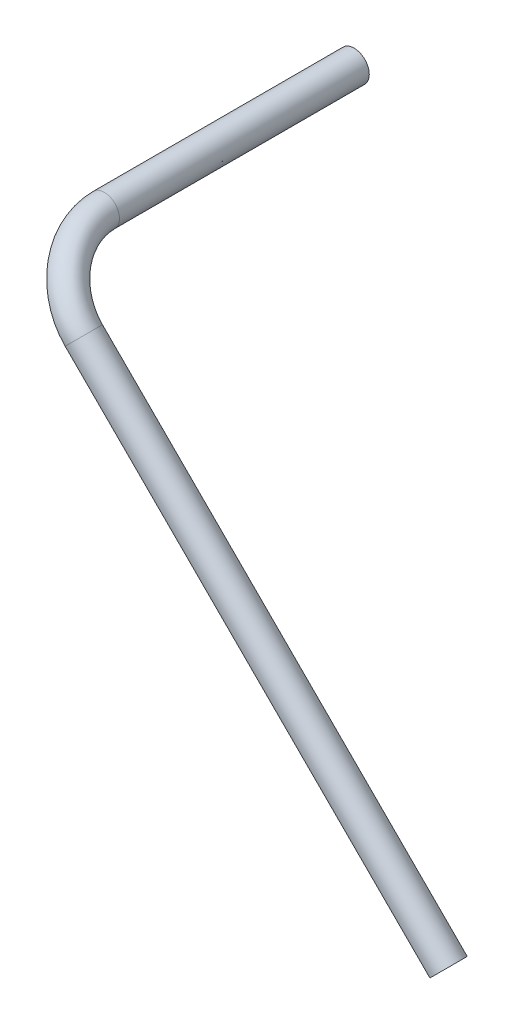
ISO-10303-21;
HEADER;
FILE_DESCRIPTION(('STEP AP214'),'2;1');
FILE_NAME('part.step','',(''),(''),'','','');
FILE_SCHEMA(('AUTOMOTIVE_DESIGN { 1 0 10303 214 1 1 1 1 }'));
ENDSEC;
DATA;
#1=APPLICATION_CONTEXT('core data for automotive mechanical design processes');
#2=APPLICATION_PROTOCOL_DEFINITION('international standard','automotive_design',2000,#1);
#3=PRODUCT_CONTEXT('',#1,'mechanical');
#4=PRODUCT('Part','Part','',(#3));
#5=PRODUCT_RELATED_PRODUCT_CATEGORY('part','',(#4));
#6=PRODUCT_DEFINITION_FORMATION('','',#4);
#7=PRODUCT_DEFINITION_CONTEXT('part definition',#1,'design');
#8=PRODUCT_DEFINITION('design','',#6,#7);
#9=PRODUCT_DEFINITION_SHAPE('','',#8);
#10=(LENGTH_UNIT() NAMED_UNIT(*) SI_UNIT(.MILLI.,.METRE.));
#11=(NAMED_UNIT(*) PLANE_ANGLE_UNIT() SI_UNIT($,.RADIAN.));
#12=(NAMED_UNIT(*) SI_UNIT($,.STERADIAN.) SOLID_ANGLE_UNIT());
#13=UNCERTAINTY_MEASURE_WITH_UNIT(LENGTH_MEASURE(1.E-05),#10,'distance_accuracy_value','');
#14=(GEOMETRIC_REPRESENTATION_CONTEXT(3) GLOBAL_UNCERTAINTY_ASSIGNED_CONTEXT((#13)) GLOBAL_UNIT_ASSIGNED_CONTEXT((#10,
#11,#12)) REPRESENTATION_CONTEXT('',''));
#15=CARTESIAN_POINT('',(0.,0.,0.));
#16=DIRECTION('',(0.,0.,1.));
#17=DIRECTION('',(1.,0.,0.));
#18=AXIS2_PLACEMENT_3D('',#15,#16,#17);
#19=CARTESIAN_POINT('',(0.,0.,0.));
#20=DIRECTION('',(0.,0.,1.));
#21=DIRECTION('',(1.,0.,0.));
#22=AXIS2_PLACEMENT_3D('',#19,#20,#21);
#23=PLANE('',#22);
#24=CARTESIAN_POINT('',(0.,0.,0.));
#25=DIRECTION('',(0.,0.,1.));
#26=DIRECTION('',(1.,0.,0.));
#27=AXIS2_PLACEMENT_3D('',#24,#25,#26);
#28=CIRCLE('',#27,13.335);
#29=CARTESIAN_POINT('',(13.335,0.,0.));
#30=VERTEX_POINT('',#29);
#31=EDGE_CURVE('E33',#30,#30,#28,.T.);
#32=ORIENTED_EDGE('',*,*,#31,.F.);
#33=EDGE_LOOP('',(#32));
#34=FACE_BOUND('',#33,.T.);
#35=CARTESIAN_POINT('',(0.,0.,0.));
#36=DIRECTION('',(0.,0.,1.));
#37=DIRECTION('',(1.,0.,0.));
#38=AXIS2_PLACEMENT_3D('',#35,#36,#37);
#39=CIRCLE('',#38,10.4648);
#40=CARTESIAN_POINT('',(10.4648,0.,0.));
#41=VERTEX_POINT('',#40);
#42=EDGE_CURVE('E40',#41,#41,#39,.T.);
#43=ORIENTED_EDGE('',*,*,#42,.T.);
#44=EDGE_LOOP('',(#43));
#45=FACE_BOUND('',#44,.T.);
#46=ADVANCED_FACE('F29',(#34,#45),#23,.F.);
#47=CARTESIAN_POINT('',(0.,0.,218.51725641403));
#48=DIRECTION('',(0.,0.,-1.));
#49=DIRECTION('',(-1.,0.,0.));
#50=AXIS2_PLACEMENT_3D('',#47,#48,#49);
#51=CYLINDRICAL_SURFACE('',#50,13.335);
#52=CARTESIAN_POINT('',(0.,0.,218.51725641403));
#53=DIRECTION('',(0.,0.,1.));
#54=DIRECTION('',(1.,0.,0.));
#55=AXIS2_PLACEMENT_3D('',#52,#53,#54);
#56=CIRCLE('',#55,13.335);
#57=CARTESIAN_POINT('',(-9.42926892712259,9.42926892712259,218.51725641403));
#58=VERTEX_POINT('',#57);
#59=EDGE_CURVE('E10',#58,#58,#56,.T.);
#60=ORIENTED_EDGE('',*,*,#59,.F.);
#61=EDGE_LOOP('',(#60));
#62=FACE_BOUND('',#61,.T.);
#63=ORIENTED_EDGE('',*,*,#31,.T.);
#64=EDGE_LOOP('',(#63));
#65=FACE_BOUND('',#64,.T.);
#66=ADVANCED_FACE('F31',(#62,#65),#51,.T.);
#67=CARTESIAN_POINT('',(0.,0.,218.51725641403));
#68=DIRECTION('',(0.,0.,-1.));
#69=DIRECTION('',(-1.,0.,0.));
#70=AXIS2_PLACEMENT_3D('',#67,#68,#69);
#71=CYLINDRICAL_SURFACE('',#70,10.4648);
#72=CARTESIAN_POINT('',(0.,0.,218.51725641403));
#73=DIRECTION('',(0.,0.,1.));
#74=DIRECTION('',(1.,0.,0.));
#75=AXIS2_PLACEMENT_3D('',#72,#73,#74);
#76=CIRCLE('',#75,10.4648);
#77=CARTESIAN_POINT('',(-7.39973104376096,7.39973104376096,218.51725641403));
#78=VERTEX_POINT('',#77);
#79=EDGE_CURVE('E47',#78,#78,#76,.T.);
#80=ORIENTED_EDGE('',*,*,#79,.T.);
#81=EDGE_LOOP('',(#80));
#82=FACE_BOUND('',#81,.T.);
#83=ORIENTED_EDGE('',*,*,#42,.F.);
#84=EDGE_LOOP('',(#83));
#85=FACE_BOUND('',#84,.T.);
#86=ADVANCED_FACE('F84',(#82,#85),#71,.F.);
#87=CARTESIAN_POINT('',(43.105229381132,-43.105229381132,218.51725641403));
#88=DIRECTION('',(-0.707106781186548,-0.707106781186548,0.));
#89=DIRECTION('',(0.707106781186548,-0.707106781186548,0.));
#90=AXIS2_PLACEMENT_3D('',#87,#88,#89);
#91=TOROIDAL_SURFACE('',#90,60.96,10.4648);
#92=CARTESIAN_POINT('',(43.105229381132,-43.105229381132,279.47725641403));
#93=DIRECTION('',(0.707106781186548,-0.707106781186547,0.));
#94=DIRECTION('',(0.707106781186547,0.707106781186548,0.));
#95=AXIS2_PLACEMENT_3D('',#92,#93,#94);
#96=CIRCLE('',#95,10.4648);
#97=CARTESIAN_POINT('',(43.105229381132,-43.105229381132,289.94205641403));
#98=VERTEX_POINT('',#97);
#99=EDGE_CURVE('E54',#98,#98,#96,.T.);
#100=CARTESIAN_POINT('',(43.105229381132,-43.105229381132,218.51725641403));
#101=DIRECTION('',(-0.707106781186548,-0.707106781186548,0.));
#102=DIRECTION('',(0.707106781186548,-0.707106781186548,0.));
#103=AXIS2_PLACEMENT_3D('',#100,#101,#102);
#104=CIRCLE('',#103,71.4248);
#105=EDGE_CURVE('',#98,#78,#104,.T.);
#106=ORIENTED_EDGE('',*,*,#99,.T.);
#107=ORIENTED_EDGE('',*,*,#79,.F.);
#108=ORIENTED_EDGE('',*,*,#105,.T.);
#109=ORIENTED_EDGE('',*,*,#105,.F.);
#110=EDGE_LOOP('',(#106,#108,#107,#109));
#111=FACE_BOUND('',#110,.T.);
#112=ADVANCED_FACE('F75',(#111),#91,.F.);
#113=CARTESIAN_POINT('',(43.105229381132,-43.105229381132,218.51725641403));
#114=DIRECTION('',(-0.707106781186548,-0.707106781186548,0.));
#115=DIRECTION('',(0.707106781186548,-0.707106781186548,0.));
#116=AXIS2_PLACEMENT_3D('',#113,#114,#115);
#117=TOROIDAL_SURFACE('',#116,60.96,13.335);
#118=CARTESIAN_POINT('',(43.105229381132,-43.105229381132,279.47725641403));
#119=DIRECTION('',(0.707106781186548,-0.707106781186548,0.));
#120=DIRECTION('',(0.5,0.5,-0.707106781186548));
#121=AXIS2_PLACEMENT_3D('',#118,#119,#120);
#122=CIRCLE('',#121,13.335);
#123=CARTESIAN_POINT('',(43.105229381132,-43.105229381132,292.81225641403));
#124=VERTEX_POINT('',#123);
#125=EDGE_CURVE('E44',#124,#124,#122,.T.);
#126=CARTESIAN_POINT('',(43.105229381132,-43.105229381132,218.51725641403));
#127=DIRECTION('',(-0.707106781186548,-0.707106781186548,0.));
#128=DIRECTION('',(0.707106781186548,-0.707106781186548,0.));
#129=AXIS2_PLACEMENT_3D('',#126,#127,#128);
#130=CIRCLE('',#129,74.295);
#131=EDGE_CURVE('',#124,#58,#130,.T.);
#132=ORIENTED_EDGE('',*,*,#125,.F.);
#133=ORIENTED_EDGE('',*,*,#59,.T.);
#134=ORIENTED_EDGE('',*,*,#131,.T.);
#135=ORIENTED_EDGE('',*,*,#131,.F.);
#136=EDGE_LOOP('',(#132,#134,#133,#135));
#137=FACE_BOUND('',#136,.T.);
#138=ADVANCED_FACE('F66',(#137),#117,.T.);
#139=CARTESIAN_POINT('',(362.169471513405,-362.169471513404,279.47725641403));
#140=DIRECTION('',(0.707106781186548,-0.707106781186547,0.));
#141=DIRECTION('',(0.707106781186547,0.707106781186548,0.));
#142=AXIS2_PLACEMENT_3D('',#139,#140,#141);
#143=PLANE('',#142);
#144=CARTESIAN_POINT('',(362.169471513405,-362.169471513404,279.47725641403));
#145=DIRECTION('',(0.707106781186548,-0.707106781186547,0.));
#146=DIRECTION('',(0.707106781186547,0.707106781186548,0.));
#147=AXIS2_PLACEMENT_3D('',#144,#145,#146);
#148=CIRCLE('',#147,13.335);
#149=CARTESIAN_POINT('',(371.598740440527,-352.740202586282,279.47725641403));
#150=VERTEX_POINT('',#149);
#151=EDGE_CURVE('E50',#150,#150,#148,.T.);
#152=ORIENTED_EDGE('',*,*,#151,.T.);
#153=EDGE_LOOP('',(#152));
#154=FACE_BOUND('',#153,.T.);
#155=CARTESIAN_POINT('',(362.169471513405,-362.169471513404,279.47725641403));
#156=DIRECTION('',(0.707106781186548,-0.707106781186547,0.));
#157=DIRECTION('',(0.707106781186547,0.707106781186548,0.));
#158=AXIS2_PLACEMENT_3D('',#155,#156,#157);
#159=CIRCLE('',#158,10.4648);
#160=CARTESIAN_POINT('',(369.569202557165,-354.769740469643,279.47725641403));
#161=VERTEX_POINT('',#160);
#162=EDGE_CURVE('E53',#161,#161,#159,.T.);
#163=ORIENTED_EDGE('',*,*,#162,.F.);
#164=EDGE_LOOP('',(#163));
#165=FACE_BOUND('',#164,.T.);
#166=ADVANCED_FACE('F63',(#154,#165),#143,.T.);
#167=CARTESIAN_POINT('',(362.169471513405,-362.169471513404,279.47725641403));
#168=DIRECTION('',(-0.707106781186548,0.707106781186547,0.));
#169=DIRECTION('',(-0.707106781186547,-0.707106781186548,0.));
#170=AXIS2_PLACEMENT_3D('',#167,#168,#169);
#171=CYLINDRICAL_SURFACE('',#170,13.335);
#172=ORIENTED_EDGE('',*,*,#151,.F.);
#173=EDGE_LOOP('',(#172));
#174=FACE_BOUND('',#173,.T.);
#175=ORIENTED_EDGE('',*,*,#125,.T.);
#176=EDGE_LOOP('',(#175));
#177=FACE_BOUND('',#176,.T.);
#178=ADVANCED_FACE('F65',(#174,#177),#171,.T.);
#179=CARTESIAN_POINT('',(362.169471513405,-362.169471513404,279.47725641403));
#180=DIRECTION('',(-0.707106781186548,0.707106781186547,0.));
#181=DIRECTION('',(-0.707106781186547,-0.707106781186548,0.));
#182=AXIS2_PLACEMENT_3D('',#179,#180,#181);
#183=CYLINDRICAL_SURFACE('',#182,10.4648);
#184=ORIENTED_EDGE('',*,*,#162,.T.);
#185=EDGE_LOOP('',(#184));
#186=FACE_BOUND('',#185,.T.);
#187=ORIENTED_EDGE('',*,*,#99,.F.);
#188=EDGE_LOOP('',(#187));
#189=FACE_BOUND('',#188,.T.);
#190=ADVANCED_FACE('F60',(#186,#189),#183,.F.);
#191=CLOSED_SHELL('',(#46,#66,#86,#112,#138,#166,#178,#190));
#192=MANIFOLD_SOLID_BREP('B2',#191);
#193=ADVANCED_BREP_SHAPE_REPRESENTATION('',(#18,#192),#14);
#194=SHAPE_DEFINITION_REPRESENTATION(#9,#193);
ENDSEC;
END-ISO-10303-21;
